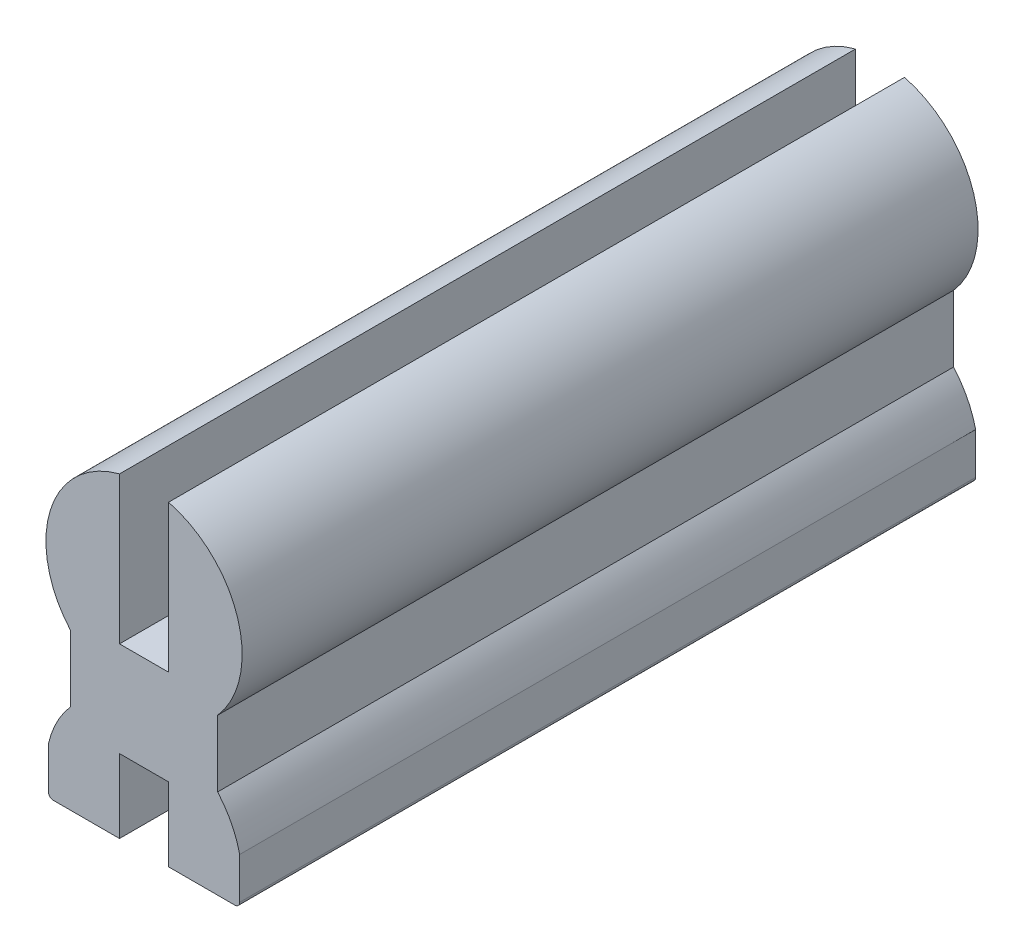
ISO-10303-21;
HEADER;
FILE_DESCRIPTION(('STEP AP214'),'2;1');
FILE_NAME('part.step','',(''),(''),'','','');
FILE_SCHEMA(('AUTOMOTIVE_DESIGN { 1 0 10303 214 1 1 1 1 }'));
ENDSEC;
DATA;
#1=APPLICATION_CONTEXT('core data for automotive mechanical design processes');
#2=APPLICATION_PROTOCOL_DEFINITION('international standard','automotive_design',2000,#1);
#3=PRODUCT_CONTEXT('',#1,'mechanical');
#4=PRODUCT('Part','Part','',(#3));
#5=PRODUCT_RELATED_PRODUCT_CATEGORY('part','',(#4));
#6=PRODUCT_DEFINITION_FORMATION('','',#4);
#7=PRODUCT_DEFINITION_CONTEXT('part definition',#1,'design');
#8=PRODUCT_DEFINITION('design','',#6,#7);
#9=PRODUCT_DEFINITION_SHAPE('','',#8);
#10=(LENGTH_UNIT() NAMED_UNIT(*) SI_UNIT(.MILLI.,.METRE.));
#11=(NAMED_UNIT(*) PLANE_ANGLE_UNIT() SI_UNIT($,.RADIAN.));
#12=(NAMED_UNIT(*) SI_UNIT($,.STERADIAN.) SOLID_ANGLE_UNIT());
#13=UNCERTAINTY_MEASURE_WITH_UNIT(LENGTH_MEASURE(1.E-05),#10,'distance_accuracy_value','');
#14=(GEOMETRIC_REPRESENTATION_CONTEXT(3) GLOBAL_UNCERTAINTY_ASSIGNED_CONTEXT((#13)) GLOBAL_UNIT_ASSIGNED_CONTEXT((#10,
#11,#12)) REPRESENTATION_CONTEXT('',''));
#15=CARTESIAN_POINT('',(0.,0.,0.));
#16=DIRECTION('',(0.,0.,1.));
#17=DIRECTION('',(1.,0.,0.));
#18=AXIS2_PLACEMENT_3D('',#15,#16,#17);
#19=CARTESIAN_POINT('',(0.,2.,-15.));
#20=DIRECTION('',(0.,0.,1.));
#21=DIRECTION('',(1.,0.,0.));
#22=AXIS2_PLACEMENT_3D('',#19,#20,#21);
#23=CYLINDRICAL_SURFACE('',#22,2.);
#24=CARTESIAN_POINT('',(0.,2.,0.));
#25=DIRECTION('',(0.,0.,1.));
#26=DIRECTION('',(1.,0.,0.));
#27=AXIS2_PLACEMENT_3D('',#24,#25,#26);
#28=CIRCLE('',#27,2.);
#29=CARTESIAN_POINT('',(1.5,0.677124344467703,0.));
#30=VERTEX_POINT('',#29);
#31=CARTESIAN_POINT('',(0.5,3.93649167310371,0.));
#32=VERTEX_POINT('',#31);
#33=EDGE_CURVE('E225',#30,#32,#28,.T.);
#34=ORIENTED_EDGE('',*,*,#33,.F.);
#35=DIRECTION('',(0.,0.,1.));
#36=VECTOR('',#35,1.);
#37=CARTESIAN_POINT('',(1.5,0.677124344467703,-15.));
#38=LINE('',#37,#36);
#39=CARTESIAN_POINT('',(1.5,0.677124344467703,-15.));
#40=VERTEX_POINT('',#39);
#41=EDGE_CURVE('E183',#40,#30,#38,.T.);
#42=ORIENTED_EDGE('',*,*,#41,.F.);
#43=CARTESIAN_POINT('',(0.,2.,-15.));
#44=DIRECTION('',(0.,0.,1.));
#45=DIRECTION('',(1.,0.,0.));
#46=AXIS2_PLACEMENT_3D('',#43,#44,#45);
#47=CIRCLE('',#46,2.);
#48=CARTESIAN_POINT('',(0.5,3.93649167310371,-15.));
#49=VERTEX_POINT('',#48);
#50=EDGE_CURVE('E177',#40,#49,#47,.T.);
#51=ORIENTED_EDGE('',*,*,#50,.T.);
#52=DIRECTION('',(0.,0.,1.));
#53=VECTOR('',#52,1.);
#54=CARTESIAN_POINT('',(0.5,3.93649167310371,-15.));
#55=LINE('',#54,#53);
#56=EDGE_CURVE('E159',#49,#32,#55,.T.);
#57=ORIENTED_EDGE('',*,*,#56,.T.);
#58=EDGE_LOOP('',(#34,#42,#51,#57));
#59=FACE_BOUND('',#58,.T.);
#60=ADVANCED_FACE('F34',(#59),#23,.T.);
#61=CARTESIAN_POINT('',(1.5,0.677124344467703,-15.));
#62=DIRECTION('',(1.,0.,0.));
#63=DIRECTION('',(0.,1.,0.));
#64=AXIS2_PLACEMENT_3D('',#61,#62,#63);
#65=PLANE('',#64);
#66=DIRECTION('',(0.,1.,0.));
#67=VECTOR('',#66,1.);
#68=CARTESIAN_POINT('',(1.5,0.677124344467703,0.));
#69=LINE('',#68,#67);
#70=CARTESIAN_POINT('',(1.5,-0.677124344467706,0.));
#71=VERTEX_POINT('',#70);
#72=EDGE_CURVE('E184',#71,#30,#69,.T.);
#73=ORIENTED_EDGE('',*,*,#72,.F.);
#74=DIRECTION('',(0.,0.,1.));
#75=VECTOR('',#74,1.);
#76=CARTESIAN_POINT('',(1.5,-0.677124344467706,-15.));
#77=LINE('',#76,#75);
#78=CARTESIAN_POINT('',(1.5,-0.677124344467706,-15.));
#79=VERTEX_POINT('',#78);
#80=EDGE_CURVE('E266',#79,#71,#77,.T.);
#81=ORIENTED_EDGE('',*,*,#80,.F.);
#82=DIRECTION('',(0.,1.,0.));
#83=VECTOR('',#82,1.);
#84=CARTESIAN_POINT('',(1.5,0.677124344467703,-15.));
#85=LINE('',#84,#83);
#86=EDGE_CURVE('E170',#79,#40,#85,.T.);
#87=ORIENTED_EDGE('',*,*,#86,.T.);
#88=ORIENTED_EDGE('',*,*,#41,.T.);
#89=EDGE_LOOP('',(#73,#81,#87,#88));
#90=FACE_BOUND('',#89,.T.);
#91=ADVANCED_FACE('F354',(#90),#65,.T.);
#92=CARTESIAN_POINT('',(0.,-2.,-15.));
#93=DIRECTION('',(0.,0.,1.));
#94=DIRECTION('',(1.,0.,0.));
#95=AXIS2_PLACEMENT_3D('',#92,#93,#94);
#96=CYLINDRICAL_SURFACE('',#95,2.);
#97=CARTESIAN_POINT('',(0.,-2.,0.));
#98=DIRECTION('',(0.,0.,1.));
#99=DIRECTION('',(1.,0.,0.));
#100=AXIS2_PLACEMENT_3D('',#97,#98,#99);
#101=CIRCLE('',#100,2.);
#102=CARTESIAN_POINT('',(1.95,-1.55559027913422,0.));
#103=VERTEX_POINT('',#102);
#104=EDGE_CURVE('E187',#103,#71,#101,.T.);
#105=ORIENTED_EDGE('',*,*,#104,.F.);
#106=DIRECTION('',(0.,0.,1.));
#107=VECTOR('',#106,1.);
#108=CARTESIAN_POINT('',(1.95,-1.55559027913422,-15.));
#109=LINE('',#108,#107);
#110=CARTESIAN_POINT('',(1.95,-1.55559027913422,-15.));
#111=VERTEX_POINT('',#110);
#112=EDGE_CURVE('E268',#111,#103,#109,.T.);
#113=ORIENTED_EDGE('',*,*,#112,.F.);
#114=CARTESIAN_POINT('',(0.,-2.,-15.));
#115=DIRECTION('',(0.,0.,1.));
#116=DIRECTION('',(1.,0.,0.));
#117=AXIS2_PLACEMENT_3D('',#114,#115,#116);
#118=CIRCLE('',#117,2.);
#119=EDGE_CURVE('E221',#111,#79,#118,.T.);
#120=ORIENTED_EDGE('',*,*,#119,.T.);
#121=ORIENTED_EDGE('',*,*,#80,.T.);
#122=EDGE_LOOP('',(#105,#113,#120,#121));
#123=FACE_BOUND('',#122,.T.);
#124=ADVANCED_FACE('F358',(#123),#96,.T.);
#125=CARTESIAN_POINT('',(1.95,-2.5,-15.));
#126=DIRECTION('',(1.,0.,0.));
#127=DIRECTION('',(0.,0.,-1.));
#128=AXIS2_PLACEMENT_3D('',#125,#126,#127);
#129=PLANE('',#128);
#130=DIRECTION('',(0.,1.,0.));
#131=VECTOR('',#130,1.);
#132=CARTESIAN_POINT('',(1.95,-2.5,0.));
#133=LINE('',#132,#131);
#134=CARTESIAN_POINT('',(1.95,-2.4,0.));
#135=VERTEX_POINT('',#134);
#136=EDGE_CURVE('E260',#135,#103,#133,.T.);
#137=ORIENTED_EDGE('',*,*,#136,.F.);
#138=DIRECTION('',(0.,0.,1.));
#139=VECTOR('',#138,1.);
#140=CARTESIAN_POINT('',(1.95,-2.4,-15.));
#141=LINE('',#140,#139);
#142=CARTESIAN_POINT('',(1.95,-2.4,-15.));
#143=VERTEX_POINT('',#142);
#144=EDGE_CURVE('E11',#135,#143,#141,.F.);
#145=ORIENTED_EDGE('',*,*,#144,.T.);
#146=DIRECTION('',(0.,1.,0.));
#147=VECTOR('',#146,1.);
#148=CARTESIAN_POINT('',(1.95,-2.5,-15.));
#149=LINE('',#148,#147);
#150=EDGE_CURVE('E219',#143,#111,#149,.T.);
#151=ORIENTED_EDGE('',*,*,#150,.T.);
#152=ORIENTED_EDGE('',*,*,#112,.T.);
#153=EDGE_LOOP('',(#137,#145,#151,#152));
#154=FACE_BOUND('',#153,.T.);
#155=ADVANCED_FACE('F359',(#154),#129,.T.);
#156=CARTESIAN_POINT('',(0.500000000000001,-2.5,-15.));
#157=DIRECTION('',(0.,-1.,0.));
#158=DIRECTION('',(1.,0.,0.));
#159=AXIS2_PLACEMENT_3D('',#156,#157,#158);
#160=PLANE('',#159);
#161=DIRECTION('',(1.,0.,0.));
#162=VECTOR('',#161,1.);
#163=CARTESIAN_POINT('',(0.500000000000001,-2.5,-15.));
#164=LINE('',#163,#162);
#165=CARTESIAN_POINT('',(0.500000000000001,-2.5,-15.));
#166=VERTEX_POINT('',#165);
#167=CARTESIAN_POINT('',(1.85,-2.5,-15.));
#168=VERTEX_POINT('',#167);
#169=EDGE_CURVE('E217',#166,#168,#164,.T.);
#170=ORIENTED_EDGE('',*,*,#169,.T.);
#171=DIRECTION('',(0.,0.,1.));
#172=VECTOR('',#171,1.);
#173=CARTESIAN_POINT('',(1.85,-2.5,-15.));
#174=LINE('',#173,#172);
#175=CARTESIAN_POINT('',(1.85,-2.5,0.));
#176=VERTEX_POINT('',#175);
#177=EDGE_CURVE('E42',#168,#176,#174,.T.);
#178=ORIENTED_EDGE('',*,*,#177,.T.);
#179=DIRECTION('',(1.,0.,0.));
#180=VECTOR('',#179,1.);
#181=CARTESIAN_POINT('',(0.500000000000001,-2.5,0.));
#182=LINE('',#181,#180);
#183=CARTESIAN_POINT('',(0.500000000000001,-2.5,0.));
#184=VERTEX_POINT('',#183);
#185=EDGE_CURVE('E257',#184,#176,#182,.T.);
#186=ORIENTED_EDGE('',*,*,#185,.F.);
#187=DIRECTION('',(0.,0.,1.));
#188=VECTOR('',#187,1.);
#189=CARTESIAN_POINT('',(0.500000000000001,-2.5,-15.));
#190=LINE('',#189,#188);
#191=EDGE_CURVE('E271',#166,#184,#190,.T.);
#192=ORIENTED_EDGE('',*,*,#191,.F.);
#193=EDGE_LOOP('',(#170,#178,#186,#192));
#194=FACE_BOUND('',#193,.T.);
#195=ADVANCED_FACE('F305',(#194),#160,.T.);
#196=CARTESIAN_POINT('',(0.5,-1.,-15.));
#197=DIRECTION('',(-1.,0.,0.));
#198=DIRECTION('',(0.,-1.,0.));
#199=AXIS2_PLACEMENT_3D('',#196,#197,#198);
#200=PLANE('',#199);
#201=DIRECTION('',(0.,-1.,0.));
#202=VECTOR('',#201,1.);
#203=CARTESIAN_POINT('',(0.5,-1.,0.));
#204=LINE('',#203,#202);
#205=CARTESIAN_POINT('',(0.5,-1.,0.));
#206=VERTEX_POINT('',#205);
#207=EDGE_CURVE('E254',#206,#184,#204,.T.);
#208=ORIENTED_EDGE('',*,*,#207,.F.);
#209=DIRECTION('',(0.,0.,1.));
#210=VECTOR('',#209,1.);
#211=CARTESIAN_POINT('',(0.5,-1.,-15.));
#212=LINE('',#211,#210);
#213=CARTESIAN_POINT('',(0.5,-1.,-15.));
#214=VERTEX_POINT('',#213);
#215=EDGE_CURVE('E273',#214,#206,#212,.T.);
#216=ORIENTED_EDGE('',*,*,#215,.F.);
#217=DIRECTION('',(0.,-1.,0.));
#218=VECTOR('',#217,1.);
#219=CARTESIAN_POINT('',(0.5,-1.,-15.));
#220=LINE('',#219,#218);
#221=EDGE_CURVE('E214',#214,#166,#220,.T.);
#222=ORIENTED_EDGE('',*,*,#221,.T.);
#223=ORIENTED_EDGE('',*,*,#191,.T.);
#224=EDGE_LOOP('',(#208,#216,#222,#223));
#225=FACE_BOUND('',#224,.T.);
#226=ADVANCED_FACE('F312',(#225),#200,.T.);
#227=CARTESIAN_POINT('',(-0.5,-1.,-15.));
#228=DIRECTION('',(0.,-1.,0.));
#229=DIRECTION('',(0.,0.,-1.));
#230=AXIS2_PLACEMENT_3D('',#227,#228,#229);
#231=PLANE('',#230);
#232=DIRECTION('',(1.,0.,0.));
#233=VECTOR('',#232,1.);
#234=CARTESIAN_POINT('',(-0.5,-1.,0.));
#235=LINE('',#234,#233);
#236=CARTESIAN_POINT('',(-0.5,-1.,0.));
#237=VERTEX_POINT('',#236);
#238=EDGE_CURVE('E251',#237,#206,#235,.T.);
#239=ORIENTED_EDGE('',*,*,#238,.F.);
#240=DIRECTION('',(0.,0.,1.));
#241=VECTOR('',#240,1.);
#242=CARTESIAN_POINT('',(-0.5,-1.,-15.));
#243=LINE('',#242,#241);
#244=CARTESIAN_POINT('',(-0.5,-1.,-15.));
#245=VERTEX_POINT('',#244);
#246=EDGE_CURVE('E275',#245,#237,#243,.T.);
#247=ORIENTED_EDGE('',*,*,#246,.F.);
#248=DIRECTION('',(1.,0.,0.));
#249=VECTOR('',#248,1.);
#250=CARTESIAN_POINT('',(-0.5,-1.,-15.));
#251=LINE('',#250,#249);
#252=EDGE_CURVE('E211',#245,#214,#251,.T.);
#253=ORIENTED_EDGE('',*,*,#252,.T.);
#254=ORIENTED_EDGE('',*,*,#215,.T.);
#255=EDGE_LOOP('',(#239,#247,#253,#254));
#256=FACE_BOUND('',#255,.T.);
#257=ADVANCED_FACE('F317',(#256),#231,.T.);
#258=CARTESIAN_POINT('',(-0.5,-1.,-15.));
#259=DIRECTION('',(1.,0.,0.));
#260=DIRECTION('',(0.,1.,0.));
#261=AXIS2_PLACEMENT_3D('',#258,#259,#260);
#262=PLANE('',#261);
#263=DIRECTION('',(0.,1.,0.));
#264=VECTOR('',#263,1.);
#265=CARTESIAN_POINT('',(-0.5,-1.,0.));
#266=LINE('',#265,#264);
#267=CARTESIAN_POINT('',(-0.5,-2.5,0.));
#268=VERTEX_POINT('',#267);
#269=EDGE_CURVE('E248',#268,#237,#266,.T.);
#270=ORIENTED_EDGE('',*,*,#269,.F.);
#271=DIRECTION('',(0.,0.,1.));
#272=VECTOR('',#271,1.);
#273=CARTESIAN_POINT('',(-0.5,-2.5,-15.));
#274=LINE('',#273,#272);
#275=CARTESIAN_POINT('',(-0.5,-2.5,-15.));
#276=VERTEX_POINT('',#275);
#277=EDGE_CURVE('E277',#276,#268,#274,.T.);
#278=ORIENTED_EDGE('',*,*,#277,.F.);
#279=DIRECTION('',(0.,1.,0.));
#280=VECTOR('',#279,1.);
#281=CARTESIAN_POINT('',(-0.5,-1.,-15.));
#282=LINE('',#281,#280);
#283=EDGE_CURVE('E208',#276,#245,#282,.T.);
#284=ORIENTED_EDGE('',*,*,#283,.T.);
#285=ORIENTED_EDGE('',*,*,#246,.T.);
#286=EDGE_LOOP('',(#270,#278,#284,#285));
#287=FACE_BOUND('',#286,.T.);
#288=ADVANCED_FACE('F320',(#287),#262,.T.);
#289=CARTESIAN_POINT('',(-1.95,-2.5,-15.));
#290=DIRECTION('',(0.,-1.,0.));
#291=DIRECTION('',(1.,0.,0.));
#292=AXIS2_PLACEMENT_3D('',#289,#290,#291);
#293=PLANE('',#292);
#294=DIRECTION('',(1.,0.,0.));
#295=VECTOR('',#294,1.);
#296=CARTESIAN_POINT('',(-1.95,-2.5,0.));
#297=LINE('',#296,#295);
#298=CARTESIAN_POINT('',(-1.85,-2.5,0.));
#299=VERTEX_POINT('',#298);
#300=EDGE_CURVE('E246',#299,#268,#297,.T.);
#301=ORIENTED_EDGE('',*,*,#300,.F.);
#302=DIRECTION('',(0.,0.,1.));
#303=VECTOR('',#302,1.);
#304=CARTESIAN_POINT('',(-1.85,-2.5,-15.));
#305=LINE('',#304,#303);
#306=CARTESIAN_POINT('',(-1.85,-2.5,-15.));
#307=VERTEX_POINT('',#306);
#308=EDGE_CURVE('E297',#299,#307,#305,.F.);
#309=ORIENTED_EDGE('',*,*,#308,.T.);
#310=DIRECTION('',(1.,0.,0.));
#311=VECTOR('',#310,1.);
#312=CARTESIAN_POINT('',(-1.95,-2.5,-15.));
#313=LINE('',#312,#311);
#314=EDGE_CURVE('E206',#307,#276,#313,.T.);
#315=ORIENTED_EDGE('',*,*,#314,.T.);
#316=ORIENTED_EDGE('',*,*,#277,.T.);
#317=EDGE_LOOP('',(#301,#309,#315,#316));
#318=FACE_BOUND('',#317,.T.);
#319=ADVANCED_FACE('F385',(#318),#293,.T.);
#320=CARTESIAN_POINT('',(-1.95,-2.5,-15.));
#321=DIRECTION('',(-1.,0.,0.));
#322=DIRECTION('',(0.,0.,1.));
#323=AXIS2_PLACEMENT_3D('',#320,#321,#322);
#324=PLANE('',#323);
#325=DIRECTION('',(0.,-1.,0.));
#326=VECTOR('',#325,1.);
#327=CARTESIAN_POINT('',(-1.95,-2.5,-15.));
#328=LINE('',#327,#326);
#329=CARTESIAN_POINT('',(-1.95,-1.55559027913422,-15.));
#330=VERTEX_POINT('',#329);
#331=CARTESIAN_POINT('',(-1.95,-2.4,-15.));
#332=VERTEX_POINT('',#331);
#333=EDGE_CURVE('E203',#330,#332,#328,.T.);
#334=ORIENTED_EDGE('',*,*,#333,.T.);
#335=DIRECTION('',(0.,0.,1.));
#336=VECTOR('',#335,1.);
#337=CARTESIAN_POINT('',(-1.95,-2.4,-15.));
#338=LINE('',#337,#336);
#339=CARTESIAN_POINT('',(-1.95,-2.4,0.));
#340=VERTEX_POINT('',#339);
#341=EDGE_CURVE('E265',#332,#340,#338,.T.);
#342=ORIENTED_EDGE('',*,*,#341,.T.);
#343=DIRECTION('',(0.,-1.,0.));
#344=VECTOR('',#343,1.);
#345=CARTESIAN_POINT('',(-1.95,-2.5,0.));
#346=LINE('',#345,#344);
#347=CARTESIAN_POINT('',(-1.95,-1.55559027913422,0.));
#348=VERTEX_POINT('',#347);
#349=EDGE_CURVE('E243',#348,#340,#346,.T.);
#350=ORIENTED_EDGE('',*,*,#349,.F.);
#351=DIRECTION('',(0.,0.,1.));
#352=VECTOR('',#351,1.);
#353=CARTESIAN_POINT('',(-1.95,-1.55559027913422,-15.));
#354=LINE('',#353,#352);
#355=EDGE_CURVE('E280',#330,#348,#354,.T.);
#356=ORIENTED_EDGE('',*,*,#355,.F.);
#357=EDGE_LOOP('',(#334,#342,#350,#356));
#358=FACE_BOUND('',#357,.T.);
#359=ADVANCED_FACE('F331',(#358),#324,.T.);
#360=CARTESIAN_POINT('',(0.,-2.,-15.));
#361=DIRECTION('',(0.,0.,1.));
#362=DIRECTION('',(1.,0.,0.));
#363=AXIS2_PLACEMENT_3D('',#360,#361,#362);
#364=CYLINDRICAL_SURFACE('',#363,2.);
#365=CARTESIAN_POINT('',(0.,-2.,0.));
#366=DIRECTION('',(0.,0.,1.));
#367=DIRECTION('',(1.,0.,0.));
#368=AXIS2_PLACEMENT_3D('',#365,#366,#367);
#369=CIRCLE('',#368,2.);
#370=CARTESIAN_POINT('',(-1.5,-0.677124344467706,0.));
#371=VERTEX_POINT('',#370);
#372=EDGE_CURVE('E240',#371,#348,#369,.T.);
#373=ORIENTED_EDGE('',*,*,#372,.F.);
#374=DIRECTION('',(0.,0.,1.));
#375=VECTOR('',#374,1.);
#376=CARTESIAN_POINT('',(-1.5,-0.677124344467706,-15.));
#377=LINE('',#376,#375);
#378=CARTESIAN_POINT('',(-1.5,-0.677124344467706,-15.));
#379=VERTEX_POINT('',#378);
#380=EDGE_CURVE('E282',#379,#371,#377,.T.);
#381=ORIENTED_EDGE('',*,*,#380,.F.);
#382=CARTESIAN_POINT('',(0.,-2.,-15.));
#383=DIRECTION('',(0.,0.,1.));
#384=DIRECTION('',(1.,0.,0.));
#385=AXIS2_PLACEMENT_3D('',#382,#383,#384);
#386=CIRCLE('',#385,2.);
#387=EDGE_CURVE('E200',#379,#330,#386,.T.);
#388=ORIENTED_EDGE('',*,*,#387,.T.);
#389=ORIENTED_EDGE('',*,*,#355,.T.);
#390=EDGE_LOOP('',(#373,#381,#388,#389));
#391=FACE_BOUND('',#390,.T.);
#392=ADVANCED_FACE('F336',(#391),#364,.T.);
#393=CARTESIAN_POINT('',(-1.5,0.677124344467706,-15.));
#394=DIRECTION('',(-1.,0.,0.));
#395=DIRECTION('',(0.,0.,1.));
#396=AXIS2_PLACEMENT_3D('',#393,#394,#395);
#397=PLANE('',#396);
#398=DIRECTION('',(0.,-1.,0.));
#399=VECTOR('',#398,1.);
#400=CARTESIAN_POINT('',(-1.5,0.677124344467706,0.));
#401=LINE('',#400,#399);
#402=CARTESIAN_POINT('',(-1.5,0.677124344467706,0.));
#403=VERTEX_POINT('',#402);
#404=EDGE_CURVE('E237',#403,#371,#401,.T.);
#405=ORIENTED_EDGE('',*,*,#404,.F.);
#406=DIRECTION('',(0.,0.,1.));
#407=VECTOR('',#406,1.);
#408=CARTESIAN_POINT('',(-1.5,0.677124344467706,-15.));
#409=LINE('',#408,#407);
#410=CARTESIAN_POINT('',(-1.5,0.677124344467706,-15.));
#411=VERTEX_POINT('',#410);
#412=EDGE_CURVE('E284',#411,#403,#409,.T.);
#413=ORIENTED_EDGE('',*,*,#412,.F.);
#414=DIRECTION('',(0.,-1.,0.));
#415=VECTOR('',#414,1.);
#416=CARTESIAN_POINT('',(-1.5,0.677124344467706,-15.));
#417=LINE('',#416,#415);
#418=EDGE_CURVE('E197',#411,#379,#417,.T.);
#419=ORIENTED_EDGE('',*,*,#418,.T.);
#420=ORIENTED_EDGE('',*,*,#380,.T.);
#421=EDGE_LOOP('',(#405,#413,#419,#420));
#422=FACE_BOUND('',#421,.T.);
#423=ADVANCED_FACE('F341',(#422),#397,.T.);
#424=CARTESIAN_POINT('',(0.,2.,-15.));
#425=DIRECTION('',(0.,0.,1.));
#426=DIRECTION('',(1.,0.,0.));
#427=AXIS2_PLACEMENT_3D('',#424,#425,#426);
#428=CYLINDRICAL_SURFACE('',#427,2.);
#429=CARTESIAN_POINT('',(0.,2.,0.));
#430=DIRECTION('',(0.,0.,1.));
#431=DIRECTION('',(1.,0.,0.));
#432=AXIS2_PLACEMENT_3D('',#429,#430,#431);
#433=CIRCLE('',#432,2.);
#434=CARTESIAN_POINT('',(-0.500000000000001,3.93649167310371,0.));
#435=VERTEX_POINT('',#434);
#436=EDGE_CURVE('E234',#435,#403,#433,.T.);
#437=ORIENTED_EDGE('',*,*,#436,.F.);
#438=DIRECTION('',(0.,0.,1.));
#439=VECTOR('',#438,1.);
#440=CARTESIAN_POINT('',(-0.500000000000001,3.93649167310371,-15.));
#441=LINE('',#440,#439);
#442=CARTESIAN_POINT('',(-0.500000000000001,3.93649167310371,-15.));
#443=VERTEX_POINT('',#442);
#444=EDGE_CURVE('E286',#443,#435,#441,.T.);
#445=ORIENTED_EDGE('',*,*,#444,.F.);
#446=CARTESIAN_POINT('',(0.,2.,-15.));
#447=DIRECTION('',(0.,0.,1.));
#448=DIRECTION('',(1.,0.,0.));
#449=AXIS2_PLACEMENT_3D('',#446,#447,#448);
#450=CIRCLE('',#449,2.);
#451=EDGE_CURVE('E194',#443,#411,#450,.T.);
#452=ORIENTED_EDGE('',*,*,#451,.T.);
#453=ORIENTED_EDGE('',*,*,#412,.T.);
#454=EDGE_LOOP('',(#437,#445,#452,#453));
#455=FACE_BOUND('',#454,.T.);
#456=ADVANCED_FACE('F344',(#455),#428,.T.);
#457=CARTESIAN_POINT('',(-0.500000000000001,3.93649167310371,-15.));
#458=DIRECTION('',(1.,0.,0.));
#459=DIRECTION('',(0.,1.,0.));
#460=AXIS2_PLACEMENT_3D('',#457,#458,#459);
#461=PLANE('',#460);
#462=DIRECTION('',(0.,1.,0.));
#463=VECTOR('',#462,1.);
#464=CARTESIAN_POINT('',(-0.500000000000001,3.93649167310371,0.));
#465=LINE('',#464,#463);
#466=CARTESIAN_POINT('',(-0.5,0.936491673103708,0.));
#467=VERTEX_POINT('',#466);
#468=EDGE_CURVE('E231',#467,#435,#465,.T.);
#469=ORIENTED_EDGE('',*,*,#468,.F.);
#470=DIRECTION('',(0.,0.,1.));
#471=VECTOR('',#470,1.);
#472=CARTESIAN_POINT('',(-0.5,0.936491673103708,-15.));
#473=LINE('',#472,#471);
#474=CARTESIAN_POINT('',(-0.5,0.936491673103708,-15.));
#475=VERTEX_POINT('',#474);
#476=EDGE_CURVE('E288',#475,#467,#473,.T.);
#477=ORIENTED_EDGE('',*,*,#476,.F.);
#478=DIRECTION('',(0.,1.,0.));
#479=VECTOR('',#478,1.);
#480=CARTESIAN_POINT('',(-0.500000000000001,3.93649167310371,-15.));
#481=LINE('',#480,#479);
#482=EDGE_CURVE('E191',#475,#443,#481,.T.);
#483=ORIENTED_EDGE('',*,*,#482,.T.);
#484=ORIENTED_EDGE('',*,*,#444,.T.);
#485=EDGE_LOOP('',(#469,#477,#483,#484));
#486=FACE_BOUND('',#485,.T.);
#487=ADVANCED_FACE('F347',(#486),#461,.T.);
#488=CARTESIAN_POINT('',(-0.5,0.936491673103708,-15.));
#489=DIRECTION('',(0.,1.,0.));
#490=DIRECTION('',(0.,0.,1.));
#491=AXIS2_PLACEMENT_3D('',#488,#489,#490);
#492=PLANE('',#491);
#493=DIRECTION('',(-1.,0.,0.));
#494=VECTOR('',#493,1.);
#495=CARTESIAN_POINT('',(-0.5,0.936491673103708,0.));
#496=LINE('',#495,#494);
#497=CARTESIAN_POINT('',(0.5,0.936491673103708,0.));
#498=VERTEX_POINT('',#497);
#499=EDGE_CURVE('E228',#498,#467,#496,.T.);
#500=ORIENTED_EDGE('',*,*,#499,.F.);
#501=DIRECTION('',(0.,0.,1.));
#502=VECTOR('',#501,1.);
#503=CARTESIAN_POINT('',(0.5,0.936491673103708,-15.));
#504=LINE('',#503,#502);
#505=CARTESIAN_POINT('',(0.5,0.936491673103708,-15.));
#506=VERTEX_POINT('',#505);
#507=EDGE_CURVE('E169',#506,#498,#504,.T.);
#508=ORIENTED_EDGE('',*,*,#507,.F.);
#509=DIRECTION('',(-1.,0.,0.));
#510=VECTOR('',#509,1.);
#511=CARTESIAN_POINT('',(-0.5,0.936491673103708,-15.));
#512=LINE('',#511,#510);
#513=EDGE_CURVE('E181',#506,#475,#512,.T.);
#514=ORIENTED_EDGE('',*,*,#513,.T.);
#515=ORIENTED_EDGE('',*,*,#476,.T.);
#516=EDGE_LOOP('',(#500,#508,#514,#515));
#517=FACE_BOUND('',#516,.T.);
#518=ADVANCED_FACE('F350',(#517),#492,.T.);
#519=CARTESIAN_POINT('',(0.5,0.936491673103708,-15.));
#520=DIRECTION('',(-1.,0.,0.));
#521=DIRECTION('',(0.,0.,1.));
#522=AXIS2_PLACEMENT_3D('',#519,#520,#521);
#523=PLANE('',#522);
#524=DIRECTION('',(0.,-1.,0.));
#525=VECTOR('',#524,1.);
#526=CARTESIAN_POINT('',(0.5,0.936491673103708,0.));
#527=LINE('',#526,#525);
#528=EDGE_CURVE('E164',#32,#498,#527,.T.);
#529=ORIENTED_EDGE('',*,*,#528,.F.);
#530=ORIENTED_EDGE('',*,*,#56,.F.);
#531=DIRECTION('',(0.,-1.,0.));
#532=VECTOR('',#531,1.);
#533=CARTESIAN_POINT('',(0.5,0.936491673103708,-15.));
#534=LINE('',#533,#532);
#535=EDGE_CURVE('E162',#49,#506,#534,.T.);
#536=ORIENTED_EDGE('',*,*,#535,.T.);
#537=ORIENTED_EDGE('',*,*,#507,.T.);
#538=EDGE_LOOP('',(#529,#530,#536,#537));
#539=FACE_BOUND('',#538,.T.);
#540=ADVANCED_FACE('F161',(#539),#523,.T.);
#541=CARTESIAN_POINT('',(0.,2.,-15.));
#542=DIRECTION('',(0.,0.,1.));
#543=DIRECTION('',(1.,0.,0.));
#544=AXIS2_PLACEMENT_3D('',#541,#542,#543);
#545=PLANE('',#544);
#546=ORIENTED_EDGE('',*,*,#314,.F.);
#547=CARTESIAN_POINT('',(-1.85,-2.4,-15.));
#548=DIRECTION('',(0.,0.,1.));
#549=DIRECTION('',(1.,0.,0.));
#550=AXIS2_PLACEMENT_3D('',#547,#548,#549);
#551=CIRCLE('',#550,0.1);
#552=EDGE_CURVE('E300',#307,#332,#551,.F.);
#553=ORIENTED_EDGE('',*,*,#552,.T.);
#554=ORIENTED_EDGE('',*,*,#333,.F.);
#555=ORIENTED_EDGE('',*,*,#387,.F.);
#556=ORIENTED_EDGE('',*,*,#418,.F.);
#557=ORIENTED_EDGE('',*,*,#451,.F.);
#558=ORIENTED_EDGE('',*,*,#482,.F.);
#559=ORIENTED_EDGE('',*,*,#513,.F.);
#560=ORIENTED_EDGE('',*,*,#535,.F.);
#561=ORIENTED_EDGE('',*,*,#50,.F.);
#562=ORIENTED_EDGE('',*,*,#86,.F.);
#563=ORIENTED_EDGE('',*,*,#119,.F.);
#564=ORIENTED_EDGE('',*,*,#150,.F.);
#565=CARTESIAN_POINT('',(1.85,-2.4,-15.));
#566=DIRECTION('',(0.,0.,1.));
#567=DIRECTION('',(1.,0.,0.));
#568=AXIS2_PLACEMENT_3D('',#565,#566,#567);
#569=CIRCLE('',#568,0.1);
#570=EDGE_CURVE('E49',#143,#168,#569,.F.);
#571=ORIENTED_EDGE('',*,*,#570,.T.);
#572=ORIENTED_EDGE('',*,*,#169,.F.);
#573=ORIENTED_EDGE('',*,*,#221,.F.);
#574=ORIENTED_EDGE('',*,*,#252,.F.);
#575=ORIENTED_EDGE('',*,*,#283,.F.);
#576=EDGE_LOOP('',(#546,#553,#554,#555,#556,#557,#558,#559,#560,#561,#562,#563,#564,#571,#572,
#573,#574,#575));
#577=FACE_BOUND('',#576,.T.);
#578=ADVANCED_FACE('F175',(#577),#545,.F.);
#579=CARTESIAN_POINT('',(0.,2.,0.));
#580=DIRECTION('',(0.,0.,1.));
#581=DIRECTION('',(1.,0.,0.));
#582=AXIS2_PLACEMENT_3D('',#579,#580,#581);
#583=PLANE('',#582);
#584=ORIENTED_EDGE('',*,*,#349,.T.);
#585=CARTESIAN_POINT('',(-1.85,-2.4,0.));
#586=DIRECTION('',(0.,0.,1.));
#587=DIRECTION('',(1.,0.,0.));
#588=AXIS2_PLACEMENT_3D('',#585,#586,#587);
#589=CIRCLE('',#588,0.1);
#590=EDGE_CURVE('E295',#340,#299,#589,.T.);
#591=ORIENTED_EDGE('',*,*,#590,.T.);
#592=ORIENTED_EDGE('',*,*,#300,.T.);
#593=ORIENTED_EDGE('',*,*,#269,.T.);
#594=ORIENTED_EDGE('',*,*,#238,.T.);
#595=ORIENTED_EDGE('',*,*,#207,.T.);
#596=ORIENTED_EDGE('',*,*,#185,.T.);
#597=CARTESIAN_POINT('',(1.85,-2.4,0.));
#598=DIRECTION('',(0.,0.,1.));
#599=DIRECTION('',(1.,0.,0.));
#600=AXIS2_PLACEMENT_3D('',#597,#598,#599);
#601=CIRCLE('',#600,0.1);
#602=EDGE_CURVE('E293',#176,#135,#601,.T.);
#603=ORIENTED_EDGE('',*,*,#602,.T.);
#604=ORIENTED_EDGE('',*,*,#136,.T.);
#605=ORIENTED_EDGE('',*,*,#104,.T.);
#606=ORIENTED_EDGE('',*,*,#72,.T.);
#607=ORIENTED_EDGE('',*,*,#33,.T.);
#608=ORIENTED_EDGE('',*,*,#528,.T.);
#609=ORIENTED_EDGE('',*,*,#499,.T.);
#610=ORIENTED_EDGE('',*,*,#468,.T.);
#611=ORIENTED_EDGE('',*,*,#436,.T.);
#612=ORIENTED_EDGE('',*,*,#404,.T.);
#613=ORIENTED_EDGE('',*,*,#372,.T.);
#614=EDGE_LOOP('',(#584,#591,#592,#593,#594,#595,#596,#603,#604,#605,#606,#607,#608,#609,#610,
#611,#612,#613));
#615=FACE_BOUND('',#614,.T.);
#616=ADVANCED_FACE('F308',(#615),#583,.T.);
#617=CARTESIAN_POINT('',(-1.85,-2.4,-15.));
#618=DIRECTION('',(0.,0.,1.));
#619=DIRECTION('',(1.,0.,0.));
#620=AXIS2_PLACEMENT_3D('',#617,#618,#619);
#621=CYLINDRICAL_SURFACE('',#620,0.1);
#622=ORIENTED_EDGE('',*,*,#552,.F.);
#623=ORIENTED_EDGE('',*,*,#308,.F.);
#624=ORIENTED_EDGE('',*,*,#590,.F.);
#625=ORIENTED_EDGE('',*,*,#341,.F.);
#626=EDGE_LOOP('',(#622,#623,#624,#625));
#627=FACE_BOUND('',#626,.T.);
#628=ADVANCED_FACE('F328',(#627),#621,.T.);
#629=CARTESIAN_POINT('',(1.85,-2.4,-15.));
#630=DIRECTION('',(0.,0.,1.));
#631=DIRECTION('',(1.,0.,0.));
#632=AXIS2_PLACEMENT_3D('',#629,#630,#631);
#633=CYLINDRICAL_SURFACE('',#632,0.1);
#634=ORIENTED_EDGE('',*,*,#570,.F.);
#635=ORIENTED_EDGE('',*,*,#144,.F.);
#636=ORIENTED_EDGE('',*,*,#602,.F.);
#637=ORIENTED_EDGE('',*,*,#177,.F.);
#638=EDGE_LOOP('',(#634,#635,#636,#637));
#639=FACE_BOUND('',#638,.T.);
#640=ADVANCED_FACE('F36',(#639),#633,.T.);
#641=CLOSED_SHELL('',(#60,#91,#124,#155,#195,#226,#257,#288,#319,#359,#392,#423,#456,#487,#518,
#540,#578,#616,#628,#640));
#642=MANIFOLD_SOLID_BREP('B2',#641);
#643=ADVANCED_BREP_SHAPE_REPRESENTATION('',(#18,#642),#14);
#644=SHAPE_DEFINITION_REPRESENTATION(#9,#643);
ENDSEC;
END-ISO-10303-21;
